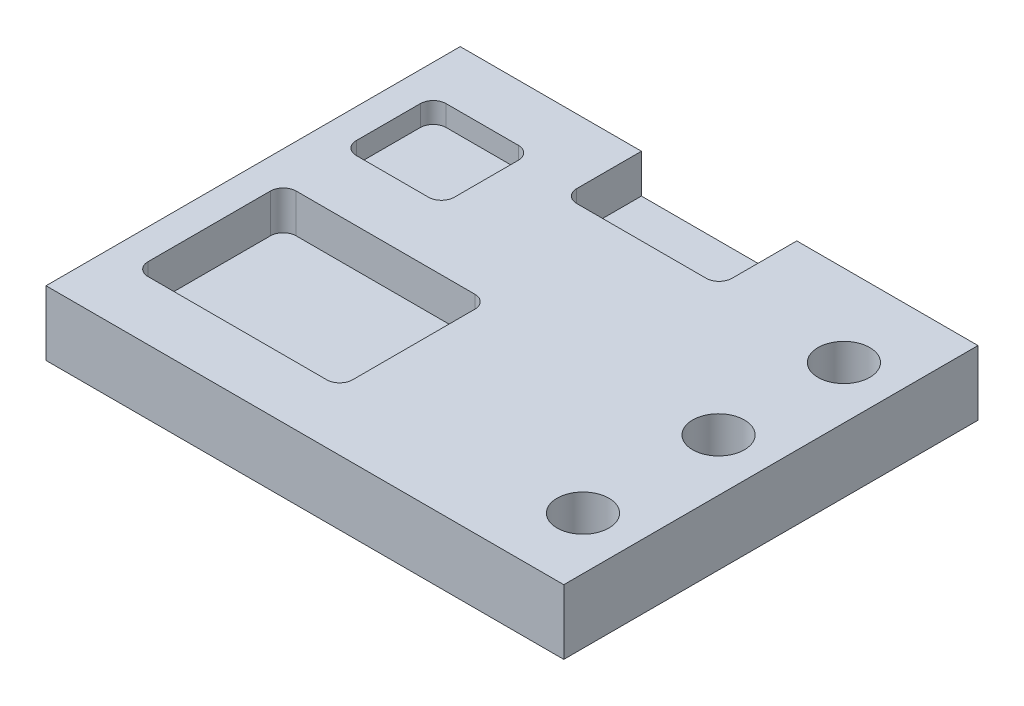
ISO-10303-21;
HEADER;
FILE_DESCRIPTION(('STEP AP214'),'2;1');
FILE_NAME('part.step','',(''),(''),'','','');
FILE_SCHEMA(('AUTOMOTIVE_DESIGN { 1 0 10303 214 1 1 1 1 }'));
ENDSEC;
DATA;
#1=APPLICATION_CONTEXT('core data for automotive mechanical design processes');
#2=APPLICATION_PROTOCOL_DEFINITION('international standard','automotive_design',2000,#1);
#3=PRODUCT_CONTEXT('',#1,'mechanical');
#4=PRODUCT('Part','Part','',(#3));
#5=PRODUCT_RELATED_PRODUCT_CATEGORY('part','',(#4));
#6=PRODUCT_DEFINITION_FORMATION('','',#4);
#7=PRODUCT_DEFINITION_CONTEXT('part definition',#1,'design');
#8=PRODUCT_DEFINITION('design','',#6,#7);
#9=PRODUCT_DEFINITION_SHAPE('','',#8);
#10=(LENGTH_UNIT() NAMED_UNIT(*) SI_UNIT(.MILLI.,.METRE.));
#11=(NAMED_UNIT(*) PLANE_ANGLE_UNIT() SI_UNIT($,.RADIAN.));
#12=(NAMED_UNIT(*) SI_UNIT($,.STERADIAN.) SOLID_ANGLE_UNIT());
#13=UNCERTAINTY_MEASURE_WITH_UNIT(LENGTH_MEASURE(1.E-05),#10,'distance_accuracy_value','');
#14=(GEOMETRIC_REPRESENTATION_CONTEXT(3) GLOBAL_UNCERTAINTY_ASSIGNED_CONTEXT((#13)) GLOBAL_UNIT_ASSIGNED_CONTEXT((#10,
#11,#12)) REPRESENTATION_CONTEXT('',''));
#15=CARTESIAN_POINT('',(0.,0.,0.));
#16=DIRECTION('',(0.,0.,1.));
#17=DIRECTION('',(1.,0.,0.));
#18=AXIS2_PLACEMENT_3D('',#15,#16,#17);
#19=CARTESIAN_POINT('',(-63.5,15.875,-50.8));
#20=DIRECTION('',(1.,0.,0.));
#21=DIRECTION('',(0.,0.,-1.));
#22=AXIS2_PLACEMENT_3D('',#19,#20,#21);
#23=PLANE('',#22);
#24=DIRECTION('',(0.,0.,1.));
#25=VECTOR('',#24,1.);
#26=CARTESIAN_POINT('',(-63.5,0.,-50.8));
#27=LINE('',#26,#25);
#28=CARTESIAN_POINT('',(-63.5,0.,-50.8));
#29=VERTEX_POINT('',#28);
#30=CARTESIAN_POINT('',(-63.5,0.,50.8));
#31=VERTEX_POINT('',#30);
#32=EDGE_CURVE('E370',#29,#31,#27,.T.);
#33=ORIENTED_EDGE('',*,*,#32,.T.);
#34=DIRECTION('',(0.,-1.,0.));
#35=VECTOR('',#34,1.);
#36=CARTESIAN_POINT('',(-63.5,15.875,50.8));
#37=LINE('',#36,#35);
#38=CARTESIAN_POINT('',(-63.5,15.875,50.8));
#39=VERTEX_POINT('',#38);
#40=EDGE_CURVE('E253',#39,#31,#37,.T.);
#41=ORIENTED_EDGE('',*,*,#40,.F.);
#42=DIRECTION('',(0.,0.,1.));
#43=VECTOR('',#42,1.);
#44=CARTESIAN_POINT('',(-63.5,15.875,-50.8));
#45=LINE('',#44,#43);
#46=CARTESIAN_POINT('',(-63.5,15.875,-50.8));
#47=VERTEX_POINT('',#46);
#48=EDGE_CURVE('E379',#47,#39,#45,.T.);
#49=ORIENTED_EDGE('',*,*,#48,.F.);
#50=DIRECTION('',(0.,-1.,0.));
#51=VECTOR('',#50,1.);
#52=CARTESIAN_POINT('',(-63.5,15.875,-50.8));
#53=LINE('',#52,#51);
#54=EDGE_CURVE('E240',#47,#29,#53,.T.);
#55=ORIENTED_EDGE('',*,*,#54,.T.);
#56=EDGE_LOOP('',(#33,#41,#49,#55));
#57=FACE_BOUND('',#56,.T.);
#58=ADVANCED_FACE('F39',(#57),#23,.F.);
#59=CARTESIAN_POINT('',(-63.5,15.875,50.8));
#60=DIRECTION('',(0.,0.,-1.));
#61=DIRECTION('',(-1.,0.,0.));
#62=AXIS2_PLACEMENT_3D('',#59,#60,#61);
#63=PLANE('',#62);
#64=DIRECTION('',(1.,0.,0.));
#65=VECTOR('',#64,1.);
#66=CARTESIAN_POINT('',(-63.5,0.,50.8));
#67=LINE('',#66,#65);
#68=CARTESIAN_POINT('',(63.5,0.,50.8));
#69=VERTEX_POINT('',#68);
#70=EDGE_CURVE('E373',#31,#69,#67,.T.);
#71=ORIENTED_EDGE('',*,*,#70,.T.);
#72=DIRECTION('',(0.,-1.,0.));
#73=VECTOR('',#72,1.);
#74=CARTESIAN_POINT('',(63.5,15.875,50.8));
#75=LINE('',#74,#73);
#76=CARTESIAN_POINT('',(63.5,15.875,50.8));
#77=VERTEX_POINT('',#76);
#78=EDGE_CURVE('E250',#77,#69,#75,.T.);
#79=ORIENTED_EDGE('',*,*,#78,.F.);
#80=DIRECTION('',(1.,0.,0.));
#81=VECTOR('',#80,1.);
#82=CARTESIAN_POINT('',(-63.5,15.875,50.8));
#83=LINE('',#82,#81);
#84=EDGE_CURVE('E381',#39,#77,#83,.T.);
#85=ORIENTED_EDGE('',*,*,#84,.F.);
#86=ORIENTED_EDGE('',*,*,#40,.T.);
#87=EDGE_LOOP('',(#71,#79,#85,#86));
#88=FACE_BOUND('',#87,.T.);
#89=ADVANCED_FACE('F389',(#88),#63,.F.);
#90=CARTESIAN_POINT('',(63.5,15.875,-50.8));
#91=DIRECTION('',(-1.,0.,0.));
#92=DIRECTION('',(0.,0.,1.));
#93=AXIS2_PLACEMENT_3D('',#90,#91,#92);
#94=PLANE('',#93);
#95=DIRECTION('',(0.,0.,-1.));
#96=VECTOR('',#95,1.);
#97=CARTESIAN_POINT('',(63.5,0.,-50.8));
#98=LINE('',#97,#96);
#99=CARTESIAN_POINT('',(63.5,0.,-50.8));
#100=VERTEX_POINT('',#99);
#101=EDGE_CURVE('E375',#69,#100,#98,.T.);
#102=ORIENTED_EDGE('',*,*,#101,.T.);
#103=DIRECTION('',(0.,-1.,0.));
#104=VECTOR('',#103,1.);
#105=CARTESIAN_POINT('',(63.5,15.875,-50.8));
#106=LINE('',#105,#104);
#107=CARTESIAN_POINT('',(63.5,15.875,-50.8));
#108=VERTEX_POINT('',#107);
#109=EDGE_CURVE('E244',#108,#100,#106,.T.);
#110=ORIENTED_EDGE('',*,*,#109,.F.);
#111=DIRECTION('',(0.,0.,-1.));
#112=VECTOR('',#111,1.);
#113=CARTESIAN_POINT('',(63.5,15.875,-50.8));
#114=LINE('',#113,#112);
#115=EDGE_CURVE('E238',#77,#108,#114,.T.);
#116=ORIENTED_EDGE('',*,*,#115,.F.);
#117=ORIENTED_EDGE('',*,*,#78,.T.);
#118=EDGE_LOOP('',(#102,#110,#116,#117));
#119=FACE_BOUND('',#118,.T.);
#120=ADVANCED_FACE('F392',(#119),#94,.F.);
#121=CARTESIAN_POINT('',(-63.5,15.875,-50.8));
#122=DIRECTION('',(0.,0.,1.));
#123=DIRECTION('',(1.,0.,0.));
#124=AXIS2_PLACEMENT_3D('',#121,#122,#123);
#125=PLANE('',#124);
#126=DIRECTION('',(-1.,0.,0.));
#127=VECTOR('',#126,1.);
#128=CARTESIAN_POINT('',(-19.05,6.35,-50.8));
#129=LINE('',#128,#127);
#130=CARTESIAN_POINT('',(19.05,6.35,-50.8));
#131=VERTEX_POINT('',#130);
#132=CARTESIAN_POINT('',(-19.05,6.35,-50.8));
#133=VERTEX_POINT('',#132);
#134=EDGE_CURVE('E222',#131,#133,#129,.T.);
#135=ORIENTED_EDGE('',*,*,#134,.F.);
#136=DIRECTION('',(0.,1.,0.));
#137=VECTOR('',#136,1.);
#138=CARTESIAN_POINT('',(19.05,6.35,-50.8));
#139=LINE('',#138,#137);
#140=CARTESIAN_POINT('',(19.05,15.875,-50.8));
#141=VERTEX_POINT('',#140);
#142=EDGE_CURVE('E216',#131,#141,#139,.T.);
#143=ORIENTED_EDGE('',*,*,#142,.T.);
#144=DIRECTION('',(-1.,0.,0.));
#145=VECTOR('',#144,1.);
#146=CARTESIAN_POINT('',(-63.5,15.875,-50.8));
#147=LINE('',#146,#145);
#148=EDGE_CURVE('E229',#108,#141,#147,.T.);
#149=ORIENTED_EDGE('',*,*,#148,.F.);
#150=ORIENTED_EDGE('',*,*,#109,.T.);
#151=DIRECTION('',(-1.,0.,0.));
#152=VECTOR('',#151,1.);
#153=CARTESIAN_POINT('',(-63.5,0.,-50.8));
#154=LINE('',#153,#152);
#155=EDGE_CURVE('E377',#100,#29,#154,.T.);
#156=ORIENTED_EDGE('',*,*,#155,.T.);
#157=ORIENTED_EDGE('',*,*,#54,.F.);
#158=CARTESIAN_POINT('',(-19.05,15.875,-50.8));
#159=VERTEX_POINT('',#158);
#160=EDGE_CURVE('E241',#159,#47,#147,.T.);
#161=ORIENTED_EDGE('',*,*,#160,.F.);
#162=DIRECTION('',(0.,1.,0.));
#163=VECTOR('',#162,1.);
#164=CARTESIAN_POINT('',(-19.05,6.35,-50.8));
#165=LINE('',#164,#163);
#166=EDGE_CURVE('E233',#133,#159,#165,.T.);
#167=ORIENTED_EDGE('',*,*,#166,.F.);
#168=EDGE_LOOP('',(#135,#143,#149,#150,#156,#157,#161,#167));
#169=FACE_BOUND('',#168,.T.);
#170=ADVANCED_FACE('F227',(#169),#125,.F.);
#171=CARTESIAN_POINT('',(-63.5,15.875,50.8));
#172=DIRECTION('',(0.,1.,0.));
#173=DIRECTION('',(0.,0.,1.));
#174=AXIS2_PLACEMENT_3D('',#171,#172,#173);
#175=PLANE('',#174);
#176=CARTESIAN_POINT('',(50.6552706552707,15.875,33.2425213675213));
#177=DIRECTION('',(0.,1.,0.));
#178=DIRECTION('',(0.,0.,1.));
#179=AXIS2_PLACEMENT_3D('',#176,#177,#178);
#180=CIRCLE('',#179,6.35);
#181=CARTESIAN_POINT('',(50.6552706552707,15.875,39.5925213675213));
#182=VERTEX_POINT('',#181);
#183=EDGE_CURVE('E851',#182,#182,#180,.T.);
#184=ORIENTED_EDGE('',*,*,#183,.F.);
#185=EDGE_LOOP('',(#184));
#186=FACE_BOUND('',#185,.T.);
#187=CARTESIAN_POINT('',(50.6552706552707,15.875,0.));
#188=DIRECTION('',(0.,1.,0.));
#189=DIRECTION('',(0.,0.,1.));
#190=AXIS2_PLACEMENT_3D('',#187,#188,#189);
#191=CIRCLE('',#190,6.35);
#192=CARTESIAN_POINT('',(50.6552706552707,15.875,6.35));
#193=VERTEX_POINT('',#192);
#194=EDGE_CURVE('E843',#193,#193,#191,.T.);
#195=ORIENTED_EDGE('',*,*,#194,.F.);
#196=EDGE_LOOP('',(#195));
#197=FACE_BOUND('',#196,.T.);
#198=CARTESIAN_POINT('',(50.6552706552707,15.875,-30.7549857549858));
#199=DIRECTION('',(0.,1.,0.));
#200=DIRECTION('',(0.,0.,1.));
#201=AXIS2_PLACEMENT_3D('',#198,#199,#200);
#202=CIRCLE('',#201,6.35);
#203=CARTESIAN_POINT('',(50.6552706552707,15.875,-24.4049857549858));
#204=VERTEX_POINT('',#203);
#205=EDGE_CURVE('E411',#204,#204,#202,.T.);
#206=ORIENTED_EDGE('',*,*,#205,.F.);
#207=EDGE_LOOP('',(#206));
#208=FACE_BOUND('',#207,.T.);
#209=DIRECTION('',(0.,0.,-1.));
#210=VECTOR('',#209,1.);
#211=CARTESIAN_POINT('',(19.05,15.875,-50.8));
#212=LINE('',#211,#210);
#213=CARTESIAN_POINT('',(19.05,15.875,-34.925));
#214=VERTEX_POINT('',#213);
#215=EDGE_CURVE('E212',#214,#141,#212,.T.);
#216=ORIENTED_EDGE('',*,*,#215,.F.);
#217=CARTESIAN_POINT('',(15.875,15.875,-34.925));
#218=DIRECTION('',(0.,1.,0.));
#219=DIRECTION('',(0.,0.,1.));
#220=AXIS2_PLACEMENT_3D('',#217,#218,#219);
#221=CIRCLE('',#220,3.175);
#222=CARTESIAN_POINT('',(15.875,15.875,-31.75));
#223=VERTEX_POINT('',#222);
#224=EDGE_CURVE('E325',#214,#223,#221,.F.);
#225=ORIENTED_EDGE('',*,*,#224,.T.);
#226=DIRECTION('',(1.,0.,0.));
#227=VECTOR('',#226,1.);
#228=CARTESIAN_POINT('',(19.05,15.875,-31.75));
#229=LINE('',#228,#227);
#230=CARTESIAN_POINT('',(-15.875,15.875,-31.75));
#231=VERTEX_POINT('',#230);
#232=EDGE_CURVE('E223',#231,#223,#229,.T.);
#233=ORIENTED_EDGE('',*,*,#232,.F.);
#234=CARTESIAN_POINT('',(-15.875,15.875,-34.925));
#235=DIRECTION('',(0.,1.,0.));
#236=DIRECTION('',(0.,0.,1.));
#237=AXIS2_PLACEMENT_3D('',#234,#235,#236);
#238=CIRCLE('',#237,3.175);
#239=CARTESIAN_POINT('',(-19.05,15.875,-34.925));
#240=VERTEX_POINT('',#239);
#241=EDGE_CURVE('E323',#231,#240,#238,.F.);
#242=ORIENTED_EDGE('',*,*,#241,.T.);
#243=DIRECTION('',(0.,0.,1.));
#244=VECTOR('',#243,1.);
#245=CARTESIAN_POINT('',(-19.05,15.875,-31.75));
#246=LINE('',#245,#244);
#247=EDGE_CURVE('E402',#159,#240,#246,.T.);
#248=ORIENTED_EDGE('',*,*,#247,.F.);
#249=ORIENTED_EDGE('',*,*,#160,.T.);
#250=ORIENTED_EDGE('',*,*,#48,.T.);
#251=ORIENTED_EDGE('',*,*,#84,.T.);
#252=ORIENTED_EDGE('',*,*,#115,.T.);
#253=ORIENTED_EDGE('',*,*,#148,.T.);
#254=EDGE_LOOP('',(#216,#225,#233,#242,#248,#249,#250,#251,#252,#253));
#255=FACE_BOUND('',#254,.T.);
#256=DIRECTION('',(0.,0.,1.));
#257=VECTOR('',#256,1.);
#258=CARTESIAN_POINT('',(-56.1002057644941,15.875,0.));
#259=LINE('',#258,#257);
#260=CARTESIAN_POINT('',(-56.1002057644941,15.875,3.175));
#261=VERTEX_POINT('',#260);
#262=CARTESIAN_POINT('',(-56.1002057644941,15.875,33.1700931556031));
#263=VERTEX_POINT('',#262);
#264=EDGE_CURVE('E232',#261,#263,#259,.T.);
#265=ORIENTED_EDGE('',*,*,#264,.F.);
#266=CARTESIAN_POINT('',(-52.9252057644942,15.875,3.175));
#267=DIRECTION('',(0.,1.,0.));
#268=DIRECTION('',(0.,0.,1.));
#269=AXIS2_PLACEMENT_3D('',#266,#267,#268);
#270=CIRCLE('',#269,3.175);
#271=CARTESIAN_POINT('',(-52.9252057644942,15.875,0.));
#272=VERTEX_POINT('',#271);
#273=EDGE_CURVE('E11',#261,#272,#270,.F.);
#274=ORIENTED_EDGE('',*,*,#273,.T.);
#275=DIRECTION('',(-1.,0.,0.));
#276=VECTOR('',#275,1.);
#277=CARTESIAN_POINT('',(-56.1002057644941,15.875,0.));
#278=LINE('',#277,#276);
#279=CARTESIAN_POINT('',(-9.09593796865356,15.875,0.));
#280=VERTEX_POINT('',#279);
#281=EDGE_CURVE('E433',#280,#272,#278,.T.);
#282=ORIENTED_EDGE('',*,*,#281,.F.);
#283=CARTESIAN_POINT('',(-9.09593796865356,15.875,3.175));
#284=DIRECTION('',(0.,1.,0.));
#285=DIRECTION('',(0.,0.,1.));
#286=AXIS2_PLACEMENT_3D('',#283,#284,#285);
#287=CIRCLE('',#286,3.175);
#288=CARTESIAN_POINT('',(-5.92093796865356,15.875,3.175));
#289=VERTEX_POINT('',#288);
#290=EDGE_CURVE('E329',#280,#289,#287,.F.);
#291=ORIENTED_EDGE('',*,*,#290,.T.);
#292=DIRECTION('',(0.,0.,-1.));
#293=VECTOR('',#292,1.);
#294=CARTESIAN_POINT('',(-5.92093796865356,15.875,0.));
#295=LINE('',#294,#293);
#296=CARTESIAN_POINT('',(-5.92093796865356,15.875,33.1700931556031));
#297=VERTEX_POINT('',#296);
#298=EDGE_CURVE('E430',#297,#289,#295,.T.);
#299=ORIENTED_EDGE('',*,*,#298,.F.);
#300=CARTESIAN_POINT('',(-9.09593796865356,15.875,33.1700931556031));
#301=DIRECTION('',(0.,1.,0.));
#302=DIRECTION('',(0.,0.,1.));
#303=AXIS2_PLACEMENT_3D('',#300,#301,#302);
#304=CIRCLE('',#303,3.175);
#305=CARTESIAN_POINT('',(-9.09593796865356,15.875,36.3450931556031));
#306=VERTEX_POINT('',#305);
#307=EDGE_CURVE('E327',#297,#306,#304,.F.);
#308=ORIENTED_EDGE('',*,*,#307,.T.);
#309=DIRECTION('',(1.,0.,0.));
#310=VECTOR('',#309,1.);
#311=CARTESIAN_POINT('',(-56.1002057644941,15.875,36.3450931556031));
#312=LINE('',#311,#310);
#313=CARTESIAN_POINT('',(-52.9252057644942,15.875,36.3450931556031));
#314=VERTEX_POINT('',#313);
#315=EDGE_CURVE('E427',#314,#306,#312,.T.);
#316=ORIENTED_EDGE('',*,*,#315,.F.);
#317=CARTESIAN_POINT('',(-52.9252057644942,15.875,33.1700931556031));
#318=DIRECTION('',(0.,1.,0.));
#319=DIRECTION('',(0.,0.,1.));
#320=AXIS2_PLACEMENT_3D('',#317,#318,#319);
#321=CIRCLE('',#320,3.175);
#322=EDGE_CURVE('E331',#314,#263,#321,.F.);
#323=ORIENTED_EDGE('',*,*,#322,.T.);
#324=EDGE_LOOP('',(#265,#274,#282,#291,#299,#308,#316,#323));
#325=FACE_BOUND('',#324,.T.);
#326=DIRECTION('',(0.,0.,1.));
#327=VECTOR('',#326,1.);
#328=CARTESIAN_POINT('',(-56.2829435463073,15.875,-36.9596704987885));
#329=LINE('',#328,#327);
#330=CARTESIAN_POINT('',(-56.2829435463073,15.875,-33.7846704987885));
#331=VERTEX_POINT('',#330);
#332=CARTESIAN_POINT('',(-56.2829435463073,15.875,-18.0892141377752));
#333=VERTEX_POINT('',#332);
#334=EDGE_CURVE('E340',#331,#333,#329,.T.);
#335=ORIENTED_EDGE('',*,*,#334,.F.);
#336=CARTESIAN_POINT('',(-53.1079435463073,15.875,-33.7846704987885));
#337=DIRECTION('',(0.,1.,0.));
#338=DIRECTION('',(0.,0.,1.));
#339=AXIS2_PLACEMENT_3D('',#336,#337,#338);
#340=CIRCLE('',#339,3.175);
#341=CARTESIAN_POINT('',(-53.1079435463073,15.875,-36.9596704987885));
#342=VERTEX_POINT('',#341);
#343=EDGE_CURVE('E46',#331,#342,#340,.F.);
#344=ORIENTED_EDGE('',*,*,#343,.T.);
#345=DIRECTION('',(-1.,0.,0.));
#346=VECTOR('',#345,1.);
#347=CARTESIAN_POINT('',(-56.2829435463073,15.875,-36.9596704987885));
#348=LINE('',#347,#346);
#349=CARTESIAN_POINT('',(-35.3992387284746,15.875,-36.9596704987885));
#350=VERTEX_POINT('',#349);
#351=EDGE_CURVE('E339',#350,#342,#348,.T.);
#352=ORIENTED_EDGE('',*,*,#351,.F.);
#353=CARTESIAN_POINT('',(-35.3992387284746,15.875,-33.7846704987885));
#354=DIRECTION('',(0.,1.,0.));
#355=DIRECTION('',(0.,0.,1.));
#356=AXIS2_PLACEMENT_3D('',#353,#354,#355);
#357=CIRCLE('',#356,3.175);
#358=CARTESIAN_POINT('',(-32.2242387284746,15.875,-33.7846704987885));
#359=VERTEX_POINT('',#358);
#360=EDGE_CURVE('E333',#350,#359,#357,.F.);
#361=ORIENTED_EDGE('',*,*,#360,.T.);
#362=DIRECTION('',(0.,0.,-1.));
#363=VECTOR('',#362,1.);
#364=CARTESIAN_POINT('',(-32.2242387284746,15.875,-36.9596704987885));
#365=LINE('',#364,#363);
#366=CARTESIAN_POINT('',(-32.2242387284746,15.875,-18.0892141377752));
#367=VERTEX_POINT('',#366);
#368=EDGE_CURVE('E347',#367,#359,#365,.T.);
#369=ORIENTED_EDGE('',*,*,#368,.F.);
#370=CARTESIAN_POINT('',(-35.3992387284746,15.875,-18.0892141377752));
#371=DIRECTION('',(0.,1.,0.));
#372=DIRECTION('',(0.,0.,1.));
#373=AXIS2_PLACEMENT_3D('',#370,#371,#372);
#374=CIRCLE('',#373,3.175);
#375=CARTESIAN_POINT('',(-35.3992387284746,15.875,-14.9142141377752));
#376=VERTEX_POINT('',#375);
#377=EDGE_CURVE('E335',#367,#376,#374,.F.);
#378=ORIENTED_EDGE('',*,*,#377,.T.);
#379=DIRECTION('',(1.,0.,0.));
#380=VECTOR('',#379,1.);
#381=CARTESIAN_POINT('',(-56.2829435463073,15.875,-14.9142141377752));
#382=LINE('',#381,#380);
#383=CARTESIAN_POINT('',(-53.1079435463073,15.875,-14.9142141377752));
#384=VERTEX_POINT('',#383);
#385=EDGE_CURVE('E449',#384,#376,#382,.T.);
#386=ORIENTED_EDGE('',*,*,#385,.F.);
#387=CARTESIAN_POINT('',(-53.1079435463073,15.875,-18.0892141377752));
#388=DIRECTION('',(0.,1.,0.));
#389=DIRECTION('',(0.,0.,1.));
#390=AXIS2_PLACEMENT_3D('',#387,#388,#389);
#391=CIRCLE('',#390,3.175);
#392=EDGE_CURVE('E53',#384,#333,#391,.F.);
#393=ORIENTED_EDGE('',*,*,#392,.T.);
#394=EDGE_LOOP('',(#335,#344,#352,#361,#369,#378,#386,#393));
#395=FACE_BOUND('',#394,.T.);
#396=ADVANCED_FACE('F235',(#186,#197,#208,#255,#325,#395),#175,.T.);
#397=CARTESIAN_POINT('',(-63.5,0.,50.8));
#398=DIRECTION('',(0.,1.,0.));
#399=DIRECTION('',(0.,0.,1.));
#400=AXIS2_PLACEMENT_3D('',#397,#398,#399);
#401=PLANE('',#400);
#402=CARTESIAN_POINT('',(50.6552706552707,0.,33.2425213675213));
#403=DIRECTION('',(0.,1.,0.));
#404=DIRECTION('',(0.,0.,1.));
#405=AXIS2_PLACEMENT_3D('',#402,#403,#404);
#406=CIRCLE('',#405,6.35);
#407=CARTESIAN_POINT('',(50.6552706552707,0.,39.5925213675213));
#408=VERTEX_POINT('',#407);
#409=EDGE_CURVE('E848',#408,#408,#406,.T.);
#410=ORIENTED_EDGE('',*,*,#409,.T.);
#411=EDGE_LOOP('',(#410));
#412=FACE_BOUND('',#411,.T.);
#413=CARTESIAN_POINT('',(50.6552706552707,0.,0.));
#414=DIRECTION('',(0.,1.,0.));
#415=DIRECTION('',(0.,0.,1.));
#416=AXIS2_PLACEMENT_3D('',#413,#414,#415);
#417=CIRCLE('',#416,6.35);
#418=CARTESIAN_POINT('',(50.6552706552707,0.,6.35));
#419=VERTEX_POINT('',#418);
#420=EDGE_CURVE('E841',#419,#419,#417,.T.);
#421=ORIENTED_EDGE('',*,*,#420,.T.);
#422=EDGE_LOOP('',(#421));
#423=FACE_BOUND('',#422,.T.);
#424=CARTESIAN_POINT('',(50.6552706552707,0.,-30.7549857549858));
#425=DIRECTION('',(0.,1.,0.));
#426=DIRECTION('',(0.,0.,1.));
#427=AXIS2_PLACEMENT_3D('',#424,#425,#426);
#428=CIRCLE('',#427,6.35);
#429=CARTESIAN_POINT('',(50.6552706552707,0.,-24.4049857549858));
#430=VERTEX_POINT('',#429);
#431=EDGE_CURVE('E406',#430,#430,#428,.T.);
#432=ORIENTED_EDGE('',*,*,#431,.T.);
#433=EDGE_LOOP('',(#432));
#434=FACE_BOUND('',#433,.T.);
#435=ORIENTED_EDGE('',*,*,#32,.F.);
#436=ORIENTED_EDGE('',*,*,#155,.F.);
#437=ORIENTED_EDGE('',*,*,#101,.F.);
#438=ORIENTED_EDGE('',*,*,#70,.F.);
#439=EDGE_LOOP('',(#435,#436,#437,#438));
#440=FACE_BOUND('',#439,.T.);
#441=ADVANCED_FACE('F397',(#412,#423,#434,#440),#401,.F.);
#442=CARTESIAN_POINT('',(-56.2829435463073,10.795,-36.9596704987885));
#443=DIRECTION('',(-1.,0.,0.));
#444=DIRECTION('',(0.,0.,1.));
#445=AXIS2_PLACEMENT_3D('',#442,#443,#444);
#446=PLANE('',#445);
#447=ORIENTED_EDGE('',*,*,#334,.T.);
#448=DIRECTION('',(0.,1.,0.));
#449=VECTOR('',#448,1.);
#450=CARTESIAN_POINT('',(-56.2829435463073,10.795,-18.0892141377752));
#451=LINE('',#450,#449);
#452=CARTESIAN_POINT('',(-56.2829435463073,10.795,-18.0892141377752));
#453=VERTEX_POINT('',#452);
#454=EDGE_CURVE('E321',#333,#453,#451,.F.);
#455=ORIENTED_EDGE('',*,*,#454,.T.);
#456=DIRECTION('',(0.,0.,1.));
#457=VECTOR('',#456,1.);
#458=CARTESIAN_POINT('',(-56.2829435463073,10.795,-36.9596704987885));
#459=LINE('',#458,#457);
#460=CARTESIAN_POINT('',(-56.2829435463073,10.795,-33.7846704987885));
#461=VERTEX_POINT('',#460);
#462=EDGE_CURVE('E346',#461,#453,#459,.T.);
#463=ORIENTED_EDGE('',*,*,#462,.F.);
#464=DIRECTION('',(0.,1.,0.));
#465=VECTOR('',#464,1.);
#466=CARTESIAN_POINT('',(-56.2829435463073,15.875,-33.7846704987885));
#467=LINE('',#466,#465);
#468=EDGE_CURVE('E319',#461,#331,#467,.T.);
#469=ORIENTED_EDGE('',*,*,#468,.T.);
#470=EDGE_LOOP('',(#447,#455,#463,#469));
#471=FACE_BOUND('',#470,.T.);
#472=ADVANCED_FACE('F359',(#471),#446,.F.);
#473=CARTESIAN_POINT('',(-56.2829435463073,10.795,-36.9596704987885));
#474=DIRECTION('',(0.,0.,-1.));
#475=DIRECTION('',(-1.,0.,0.));
#476=AXIS2_PLACEMENT_3D('',#473,#474,#475);
#477=PLANE('',#476);
#478=DIRECTION('',(-1.,0.,0.));
#479=VECTOR('',#478,1.);
#480=CARTESIAN_POINT('',(-56.2829435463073,10.795,-36.9596704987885));
#481=LINE('',#480,#479);
#482=CARTESIAN_POINT('',(-35.3992387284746,10.795,-36.9596704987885));
#483=VERTEX_POINT('',#482);
#484=CARTESIAN_POINT('',(-53.1079435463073,10.795,-36.9596704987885));
#485=VERTEX_POINT('',#484);
#486=EDGE_CURVE('E357',#483,#485,#481,.T.);
#487=ORIENTED_EDGE('',*,*,#486,.F.);
#488=DIRECTION('',(0.,1.,0.));
#489=VECTOR('',#488,1.);
#490=CARTESIAN_POINT('',(-35.3992387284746,15.875,-36.9596704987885));
#491=LINE('',#490,#489);
#492=EDGE_CURVE('E298',#483,#350,#491,.T.);
#493=ORIENTED_EDGE('',*,*,#492,.T.);
#494=ORIENTED_EDGE('',*,*,#351,.T.);
#495=DIRECTION('',(0.,1.,0.));
#496=VECTOR('',#495,1.);
#497=CARTESIAN_POINT('',(-53.1079435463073,10.795,-36.9596704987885));
#498=LINE('',#497,#496);
#499=EDGE_CURVE('E296',#342,#485,#498,.F.);
#500=ORIENTED_EDGE('',*,*,#499,.T.);
#501=EDGE_LOOP('',(#487,#493,#494,#500));
#502=FACE_BOUND('',#501,.T.);
#503=ADVANCED_FACE('F343',(#502),#477,.F.);
#504=CARTESIAN_POINT('',(-32.2242387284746,10.795,-36.9596704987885));
#505=DIRECTION('',(1.,0.,0.));
#506=DIRECTION('',(0.,0.,-1.));
#507=AXIS2_PLACEMENT_3D('',#504,#505,#506);
#508=PLANE('',#507);
#509=ORIENTED_EDGE('',*,*,#368,.T.);
#510=DIRECTION('',(0.,1.,0.));
#511=VECTOR('',#510,1.);
#512=CARTESIAN_POINT('',(-32.2242387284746,10.795,-33.7846704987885));
#513=LINE('',#512,#511);
#514=CARTESIAN_POINT('',(-32.2242387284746,10.795,-33.7846704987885));
#515=VERTEX_POINT('',#514);
#516=EDGE_CURVE('E304',#359,#515,#513,.F.);
#517=ORIENTED_EDGE('',*,*,#516,.T.);
#518=DIRECTION('',(0.,0.,-1.));
#519=VECTOR('',#518,1.);
#520=CARTESIAN_POINT('',(-32.2242387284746,10.795,-36.9596704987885));
#521=LINE('',#520,#519);
#522=CARTESIAN_POINT('',(-32.2242387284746,10.795,-18.0892141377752));
#523=VERTEX_POINT('',#522);
#524=EDGE_CURVE('E364',#523,#515,#521,.T.);
#525=ORIENTED_EDGE('',*,*,#524,.F.);
#526=DIRECTION('',(0.,1.,0.));
#527=VECTOR('',#526,1.);
#528=CARTESIAN_POINT('',(-32.2242387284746,15.875,-18.0892141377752));
#529=LINE('',#528,#527);
#530=EDGE_CURVE('E301',#523,#367,#529,.T.);
#531=ORIENTED_EDGE('',*,*,#530,.T.);
#532=EDGE_LOOP('',(#509,#517,#525,#531));
#533=FACE_BOUND('',#532,.T.);
#534=ADVANCED_FACE('F455',(#533),#508,.F.);
#535=CARTESIAN_POINT('',(-56.2829435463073,10.795,-14.9142141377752));
#536=DIRECTION('',(0.,0.,1.));
#537=DIRECTION('',(1.,0.,0.));
#538=AXIS2_PLACEMENT_3D('',#535,#536,#537);
#539=PLANE('',#538);
#540=ORIENTED_EDGE('',*,*,#385,.T.);
#541=DIRECTION('',(0.,1.,0.));
#542=VECTOR('',#541,1.);
#543=CARTESIAN_POINT('',(-35.3992387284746,10.795,-14.9142141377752));
#544=LINE('',#543,#542);
#545=CARTESIAN_POINT('',(-35.3992387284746,10.795,-14.9142141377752));
#546=VERTEX_POINT('',#545);
#547=EDGE_CURVE('E317',#376,#546,#544,.F.);
#548=ORIENTED_EDGE('',*,*,#547,.T.);
#549=DIRECTION('',(1.,0.,0.));
#550=VECTOR('',#549,1.);
#551=CARTESIAN_POINT('',(-56.2829435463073,10.795,-14.9142141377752));
#552=LINE('',#551,#550);
#553=CARTESIAN_POINT('',(-53.1079435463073,10.795,-14.9142141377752));
#554=VERTEX_POINT('',#553);
#555=EDGE_CURVE('E361',#554,#546,#552,.T.);
#556=ORIENTED_EDGE('',*,*,#555,.F.);
#557=DIRECTION('',(0.,1.,0.));
#558=VECTOR('',#557,1.);
#559=CARTESIAN_POINT('',(-53.1079435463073,15.875,-14.9142141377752));
#560=LINE('',#559,#558);
#561=EDGE_CURVE('E314',#554,#384,#560,.T.);
#562=ORIENTED_EDGE('',*,*,#561,.T.);
#563=EDGE_LOOP('',(#540,#548,#556,#562));
#564=FACE_BOUND('',#563,.T.);
#565=ADVANCED_FACE('F466',(#564),#539,.F.);
#566=CARTESIAN_POINT('',(-56.2829435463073,10.795,-14.9142141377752));
#567=DIRECTION('',(0.,1.,0.));
#568=DIRECTION('',(0.,0.,1.));
#569=AXIS2_PLACEMENT_3D('',#566,#567,#568);
#570=PLANE('',#569);
#571=ORIENTED_EDGE('',*,*,#524,.T.);
#572=CARTESIAN_POINT('',(-35.3992387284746,10.795,-33.7846704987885));
#573=DIRECTION('',(0.,1.,0.));
#574=DIRECTION('',(0.,0.,1.));
#575=AXIS2_PLACEMENT_3D('',#572,#573,#574);
#576=CIRCLE('',#575,3.175);
#577=EDGE_CURVE('E312',#515,#483,#576,.T.);
#578=ORIENTED_EDGE('',*,*,#577,.T.);
#579=ORIENTED_EDGE('',*,*,#486,.T.);
#580=CARTESIAN_POINT('',(-53.1079435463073,10.795,-33.7846704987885));
#581=DIRECTION('',(0.,1.,0.));
#582=DIRECTION('',(0.,0.,1.));
#583=AXIS2_PLACEMENT_3D('',#580,#581,#582);
#584=CIRCLE('',#583,3.175);
#585=EDGE_CURVE('E306',#485,#461,#584,.T.);
#586=ORIENTED_EDGE('',*,*,#585,.T.);
#587=ORIENTED_EDGE('',*,*,#462,.T.);
#588=CARTESIAN_POINT('',(-53.1079435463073,10.795,-18.0892141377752));
#589=DIRECTION('',(0.,1.,0.));
#590=DIRECTION('',(0.,0.,1.));
#591=AXIS2_PLACEMENT_3D('',#588,#589,#590);
#592=CIRCLE('',#591,3.175);
#593=EDGE_CURVE('E308',#453,#554,#592,.T.);
#594=ORIENTED_EDGE('',*,*,#593,.T.);
#595=ORIENTED_EDGE('',*,*,#555,.T.);
#596=CARTESIAN_POINT('',(-35.3992387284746,10.795,-18.0892141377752));
#597=DIRECTION('',(0.,1.,0.));
#598=DIRECTION('',(0.,0.,1.));
#599=AXIS2_PLACEMENT_3D('',#596,#597,#598);
#600=CIRCLE('',#599,3.175);
#601=EDGE_CURVE('E310',#546,#523,#600,.T.);
#602=ORIENTED_EDGE('',*,*,#601,.T.);
#603=EDGE_LOOP('',(#571,#578,#579,#586,#587,#594,#595,#602));
#604=FACE_BOUND('',#603,.T.);
#605=ADVANCED_FACE('F355',(#604),#570,.T.);
#606=CARTESIAN_POINT('',(-56.1002057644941,6.35,0.));
#607=DIRECTION('',(-1.,0.,0.));
#608=DIRECTION('',(0.,0.,1.));
#609=AXIS2_PLACEMENT_3D('',#606,#607,#608);
#610=PLANE('',#609);
#611=ORIENTED_EDGE('',*,*,#264,.T.);
#612=DIRECTION('',(0.,1.,0.));
#613=VECTOR('',#612,1.);
#614=CARTESIAN_POINT('',(-56.1002057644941,6.35,33.1700931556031));
#615=LINE('',#614,#613);
#616=CARTESIAN_POINT('',(-56.1002057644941,6.35,33.1700931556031));
#617=VERTEX_POINT('',#616);
#618=EDGE_CURVE('E294',#263,#617,#615,.F.);
#619=ORIENTED_EDGE('',*,*,#618,.T.);
#620=DIRECTION('',(0.,0.,1.));
#621=VECTOR('',#620,1.);
#622=CARTESIAN_POINT('',(-56.1002057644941,6.35,0.));
#623=LINE('',#622,#621);
#624=CARTESIAN_POINT('',(-56.1002057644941,6.35,3.175));
#625=VERTEX_POINT('',#624);
#626=EDGE_CURVE('E436',#625,#617,#623,.T.);
#627=ORIENTED_EDGE('',*,*,#626,.F.);
#628=DIRECTION('',(0.,1.,0.));
#629=VECTOR('',#628,1.);
#630=CARTESIAN_POINT('',(-56.1002057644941,15.875,3.175));
#631=LINE('',#630,#629);
#632=EDGE_CURVE('E291',#625,#261,#631,.T.);
#633=ORIENTED_EDGE('',*,*,#632,.T.);
#634=EDGE_LOOP('',(#611,#619,#627,#633));
#635=FACE_BOUND('',#634,.T.);
#636=ADVANCED_FACE('F507',(#635),#610,.F.);
#637=CARTESIAN_POINT('',(-56.1002057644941,6.35,0.));
#638=DIRECTION('',(0.,0.,-1.));
#639=DIRECTION('',(-1.,0.,0.));
#640=AXIS2_PLACEMENT_3D('',#637,#638,#639);
#641=PLANE('',#640);
#642=DIRECTION('',(-1.,0.,0.));
#643=VECTOR('',#642,1.);
#644=CARTESIAN_POINT('',(-56.1002057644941,6.35,0.));
#645=LINE('',#644,#643);
#646=CARTESIAN_POINT('',(-9.09593796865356,6.35,0.));
#647=VERTEX_POINT('',#646);
#648=CARTESIAN_POINT('',(-52.9252057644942,6.35,0.));
#649=VERTEX_POINT('',#648);
#650=EDGE_CURVE('E445',#647,#649,#645,.T.);
#651=ORIENTED_EDGE('',*,*,#650,.F.);
#652=DIRECTION('',(0.,1.,0.));
#653=VECTOR('',#652,1.);
#654=CARTESIAN_POINT('',(-9.09593796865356,15.875,0.));
#655=LINE('',#654,#653);
#656=EDGE_CURVE('E288',#647,#280,#655,.T.);
#657=ORIENTED_EDGE('',*,*,#656,.T.);
#658=ORIENTED_EDGE('',*,*,#281,.T.);
#659=DIRECTION('',(0.,1.,0.));
#660=VECTOR('',#659,1.);
#661=CARTESIAN_POINT('',(-52.9252057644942,6.35,0.));
#662=LINE('',#661,#660);
#663=EDGE_CURVE('E286',#272,#649,#662,.F.);
#664=ORIENTED_EDGE('',*,*,#663,.T.);
#665=EDGE_LOOP('',(#651,#657,#658,#664));
#666=FACE_BOUND('',#665,.T.);
#667=ADVANCED_FACE('F510',(#666),#641,.F.);
#668=CARTESIAN_POINT('',(-5.92093796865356,6.35,0.));
#669=DIRECTION('',(1.,0.,0.));
#670=DIRECTION('',(0.,0.,-1.));
#671=AXIS2_PLACEMENT_3D('',#668,#669,#670);
#672=PLANE('',#671);
#673=DIRECTION('',(0.,0.,-1.));
#674=VECTOR('',#673,1.);
#675=CARTESIAN_POINT('',(-5.92093796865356,6.35,0.));
#676=LINE('',#675,#674);
#677=CARTESIAN_POINT('',(-5.92093796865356,6.35,33.1700931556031));
#678=VERTEX_POINT('',#677);
#679=CARTESIAN_POINT('',(-5.92093796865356,6.35,3.175));
#680=VERTEX_POINT('',#679);
#681=EDGE_CURVE('E442',#678,#680,#676,.T.);
#682=ORIENTED_EDGE('',*,*,#681,.F.);
#683=DIRECTION('',(0.,1.,0.));
#684=VECTOR('',#683,1.);
#685=CARTESIAN_POINT('',(-5.92093796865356,15.875,33.1700931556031));
#686=LINE('',#685,#684);
#687=EDGE_CURVE('E270',#678,#297,#686,.T.);
#688=ORIENTED_EDGE('',*,*,#687,.T.);
#689=ORIENTED_EDGE('',*,*,#298,.T.);
#690=DIRECTION('',(0.,1.,0.));
#691=VECTOR('',#690,1.);
#692=CARTESIAN_POINT('',(-5.92093796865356,6.35,3.175));
#693=LINE('',#692,#691);
#694=EDGE_CURVE('E268',#289,#680,#693,.F.);
#695=ORIENTED_EDGE('',*,*,#694,.T.);
#696=EDGE_LOOP('',(#682,#688,#689,#695));
#697=FACE_BOUND('',#696,.T.);
#698=ADVANCED_FACE('F516',(#697),#672,.F.);
#699=CARTESIAN_POINT('',(-56.1002057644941,6.35,36.3450931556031));
#700=DIRECTION('',(0.,0.,1.));
#701=DIRECTION('',(1.,0.,0.));
#702=AXIS2_PLACEMENT_3D('',#699,#700,#701);
#703=PLANE('',#702);
#704=ORIENTED_EDGE('',*,*,#315,.T.);
#705=DIRECTION('',(0.,1.,0.));
#706=VECTOR('',#705,1.);
#707=CARTESIAN_POINT('',(-9.09593796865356,6.35,36.3450931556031));
#708=LINE('',#707,#706);
#709=CARTESIAN_POINT('',(-9.09593796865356,6.35,36.3450931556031));
#710=VERTEX_POINT('',#709);
#711=EDGE_CURVE('E276',#306,#710,#708,.F.);
#712=ORIENTED_EDGE('',*,*,#711,.T.);
#713=DIRECTION('',(1.,0.,0.));
#714=VECTOR('',#713,1.);
#715=CARTESIAN_POINT('',(-56.1002057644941,6.35,36.3450931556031));
#716=LINE('',#715,#714);
#717=CARTESIAN_POINT('',(-52.9252057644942,6.35,36.3450931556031));
#718=VERTEX_POINT('',#717);
#719=EDGE_CURVE('E439',#718,#710,#716,.T.);
#720=ORIENTED_EDGE('',*,*,#719,.F.);
#721=DIRECTION('',(0.,1.,0.));
#722=VECTOR('',#721,1.);
#723=CARTESIAN_POINT('',(-52.9252057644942,15.875,36.3450931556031));
#724=LINE('',#723,#722);
#725=EDGE_CURVE('E273',#718,#314,#724,.T.);
#726=ORIENTED_EDGE('',*,*,#725,.T.);
#727=EDGE_LOOP('',(#704,#712,#720,#726));
#728=FACE_BOUND('',#727,.T.);
#729=ADVANCED_FACE('F512',(#728),#703,.F.);
#730=CARTESIAN_POINT('',(-56.1002057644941,6.35,36.3450931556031));
#731=DIRECTION('',(0.,1.,0.));
#732=DIRECTION('',(0.,0.,1.));
#733=AXIS2_PLACEMENT_3D('',#730,#731,#732);
#734=PLANE('',#733);
#735=ORIENTED_EDGE('',*,*,#719,.T.);
#736=CARTESIAN_POINT('',(-9.09593796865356,6.35,33.1700931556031));
#737=DIRECTION('',(0.,1.,0.));
#738=DIRECTION('',(0.,0.,1.));
#739=AXIS2_PLACEMENT_3D('',#736,#737,#738);
#740=CIRCLE('',#739,3.175);
#741=EDGE_CURVE('E284',#710,#678,#740,.T.);
#742=ORIENTED_EDGE('',*,*,#741,.T.);
#743=ORIENTED_EDGE('',*,*,#681,.T.);
#744=CARTESIAN_POINT('',(-9.09593796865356,6.35,3.175));
#745=DIRECTION('',(0.,1.,0.));
#746=DIRECTION('',(0.,0.,1.));
#747=AXIS2_PLACEMENT_3D('',#744,#745,#746);
#748=CIRCLE('',#747,3.175);
#749=EDGE_CURVE('E282',#680,#647,#748,.T.);
#750=ORIENTED_EDGE('',*,*,#749,.T.);
#751=ORIENTED_EDGE('',*,*,#650,.T.);
#752=CARTESIAN_POINT('',(-52.9252057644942,6.35,3.175));
#753=DIRECTION('',(0.,1.,0.));
#754=DIRECTION('',(0.,0.,1.));
#755=AXIS2_PLACEMENT_3D('',#752,#753,#754);
#756=CIRCLE('',#755,3.175);
#757=EDGE_CURVE('E278',#649,#625,#756,.T.);
#758=ORIENTED_EDGE('',*,*,#757,.T.);
#759=ORIENTED_EDGE('',*,*,#626,.T.);
#760=CARTESIAN_POINT('',(-52.9252057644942,6.35,33.1700931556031));
#761=DIRECTION('',(0.,1.,0.));
#762=DIRECTION('',(0.,0.,1.));
#763=AXIS2_PLACEMENT_3D('',#760,#761,#762);
#764=CIRCLE('',#763,3.175);
#765=EDGE_CURVE('E280',#617,#718,#764,.T.);
#766=ORIENTED_EDGE('',*,*,#765,.T.);
#767=EDGE_LOOP('',(#735,#742,#743,#750,#751,#758,#759,#766));
#768=FACE_BOUND('',#767,.T.);
#769=ADVANCED_FACE('F515',(#768),#734,.T.);
#770=CARTESIAN_POINT('',(19.05,6.35,-50.8));
#771=DIRECTION('',(1.,0.,0.));
#772=DIRECTION('',(0.,0.,-1.));
#773=AXIS2_PLACEMENT_3D('',#770,#771,#772);
#774=PLANE('',#773);
#775=DIRECTION('',(0.,0.,-1.));
#776=VECTOR('',#775,1.);
#777=CARTESIAN_POINT('',(19.05,6.35,-50.8));
#778=LINE('',#777,#776);
#779=CARTESIAN_POINT('',(19.05,6.35,-34.925));
#780=VERTEX_POINT('',#779);
#781=EDGE_CURVE('E422',#780,#131,#778,.T.);
#782=ORIENTED_EDGE('',*,*,#781,.F.);
#783=DIRECTION('',(0.,1.,0.));
#784=VECTOR('',#783,1.);
#785=CARTESIAN_POINT('',(19.05,15.875,-34.925));
#786=LINE('',#785,#784);
#787=EDGE_CURVE('E219',#780,#214,#786,.T.);
#788=ORIENTED_EDGE('',*,*,#787,.T.);
#789=ORIENTED_EDGE('',*,*,#215,.T.);
#790=ORIENTED_EDGE('',*,*,#142,.F.);
#791=EDGE_LOOP('',(#782,#788,#789,#790));
#792=FACE_BOUND('',#791,.T.);
#793=ADVANCED_FACE('F215',(#792),#774,.F.);
#794=CARTESIAN_POINT('',(19.05,6.35,-31.75));
#795=DIRECTION('',(0.,0.,1.));
#796=DIRECTION('',(1.,0.,0.));
#797=AXIS2_PLACEMENT_3D('',#794,#795,#796);
#798=PLANE('',#797);
#799=DIRECTION('',(1.,0.,0.));
#800=VECTOR('',#799,1.);
#801=CARTESIAN_POINT('',(19.05,6.35,-31.75));
#802=LINE('',#801,#800);
#803=CARTESIAN_POINT('',(-15.875,6.35,-31.75));
#804=VERTEX_POINT('',#803);
#805=CARTESIAN_POINT('',(15.875,6.35,-31.75));
#806=VERTEX_POINT('',#805);
#807=EDGE_CURVE('E419',#804,#806,#802,.T.);
#808=ORIENTED_EDGE('',*,*,#807,.F.);
#809=DIRECTION('',(0.,1.,0.));
#810=VECTOR('',#809,1.);
#811=CARTESIAN_POINT('',(-15.875,15.875,-31.75));
#812=LINE('',#811,#810);
#813=EDGE_CURVE('E258',#804,#231,#812,.T.);
#814=ORIENTED_EDGE('',*,*,#813,.T.);
#815=ORIENTED_EDGE('',*,*,#232,.T.);
#816=DIRECTION('',(0.,1.,0.));
#817=VECTOR('',#816,1.);
#818=CARTESIAN_POINT('',(15.875,6.35,-31.75));
#819=LINE('',#818,#817);
#820=EDGE_CURVE('E256',#223,#806,#819,.F.);
#821=ORIENTED_EDGE('',*,*,#820,.T.);
#822=EDGE_LOOP('',(#808,#814,#815,#821));
#823=FACE_BOUND('',#822,.T.);
#824=ADVANCED_FACE('F531',(#823),#798,.F.);
#825=CARTESIAN_POINT('',(-19.05,6.35,-31.75));
#826=DIRECTION('',(-1.,0.,0.));
#827=DIRECTION('',(0.,0.,1.));
#828=AXIS2_PLACEMENT_3D('',#825,#826,#827);
#829=PLANE('',#828);
#830=ORIENTED_EDGE('',*,*,#247,.T.);
#831=DIRECTION('',(0.,1.,0.));
#832=VECTOR('',#831,1.);
#833=CARTESIAN_POINT('',(-19.05,6.35,-34.925));
#834=LINE('',#833,#832);
#835=CARTESIAN_POINT('',(-19.05,6.35,-34.925));
#836=VERTEX_POINT('',#835);
#837=EDGE_CURVE('E261',#240,#836,#834,.F.);
#838=ORIENTED_EDGE('',*,*,#837,.T.);
#839=DIRECTION('',(0.,0.,1.));
#840=VECTOR('',#839,1.);
#841=CARTESIAN_POINT('',(-19.05,6.35,-31.75));
#842=LINE('',#841,#840);
#843=EDGE_CURVE('E416',#133,#836,#842,.T.);
#844=ORIENTED_EDGE('',*,*,#843,.F.);
#845=ORIENTED_EDGE('',*,*,#166,.T.);
#846=EDGE_LOOP('',(#830,#838,#844,#845));
#847=FACE_BOUND('',#846,.T.);
#848=ADVANCED_FACE('F527',(#847),#829,.F.);
#849=CARTESIAN_POINT('',(19.05,6.35,-50.8));
#850=DIRECTION('',(0.,-1.,0.));
#851=DIRECTION('',(0.,0.,-1.));
#852=AXIS2_PLACEMENT_3D('',#849,#850,#851);
#853=PLANE('',#852);
#854=ORIENTED_EDGE('',*,*,#843,.T.);
#855=CARTESIAN_POINT('',(-15.875,6.35,-34.925));
#856=DIRECTION('',(0.,-1.,0.));
#857=DIRECTION('',(0.,0.,-1.));
#858=AXIS2_PLACEMENT_3D('',#855,#856,#857);
#859=CIRCLE('',#858,3.175);
#860=EDGE_CURVE('E265',#836,#804,#859,.F.);
#861=ORIENTED_EDGE('',*,*,#860,.T.);
#862=ORIENTED_EDGE('',*,*,#807,.T.);
#863=CARTESIAN_POINT('',(15.875,6.35,-34.925));
#864=DIRECTION('',(0.,-1.,0.));
#865=DIRECTION('',(0.,0.,-1.));
#866=AXIS2_PLACEMENT_3D('',#863,#864,#865);
#867=CIRCLE('',#866,3.175);
#868=EDGE_CURVE('E263',#806,#780,#867,.F.);
#869=ORIENTED_EDGE('',*,*,#868,.T.);
#870=ORIENTED_EDGE('',*,*,#781,.T.);
#871=ORIENTED_EDGE('',*,*,#134,.T.);
#872=EDGE_LOOP('',(#854,#861,#862,#869,#870,#871));
#873=FACE_BOUND('',#872,.T.);
#874=ADVANCED_FACE('F530',(#873),#853,.F.);
#875=CARTESIAN_POINT('',(-15.875,6.35,-34.925));
#876=DIRECTION('',(0.,-1.,0.));
#877=DIRECTION('',(0.,0.,-1.));
#878=AXIS2_PLACEMENT_3D('',#875,#876,#877);
#879=CYLINDRICAL_SURFACE('',#878,3.175);
#880=ORIENTED_EDGE('',*,*,#860,.F.);
#881=ORIENTED_EDGE('',*,*,#837,.F.);
#882=ORIENTED_EDGE('',*,*,#241,.F.);
#883=ORIENTED_EDGE('',*,*,#813,.F.);
#884=EDGE_LOOP('',(#880,#881,#882,#883));
#885=FACE_BOUND('',#884,.T.);
#886=ADVANCED_FACE('F539',(#885),#879,.F.);
#887=CARTESIAN_POINT('',(15.875,6.35,-34.925));
#888=DIRECTION('',(0.,-1.,0.));
#889=DIRECTION('',(0.,0.,-1.));
#890=AXIS2_PLACEMENT_3D('',#887,#888,#889);
#891=CYLINDRICAL_SURFACE('',#890,3.175);
#892=ORIENTED_EDGE('',*,*,#868,.F.);
#893=ORIENTED_EDGE('',*,*,#820,.F.);
#894=ORIENTED_EDGE('',*,*,#224,.F.);
#895=ORIENTED_EDGE('',*,*,#787,.F.);
#896=EDGE_LOOP('',(#892,#893,#894,#895));
#897=FACE_BOUND('',#896,.T.);
#898=ADVANCED_FACE('F543',(#897),#891,.F.);
#899=CARTESIAN_POINT('',(-9.09593796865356,6.35,33.1700931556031));
#900=DIRECTION('',(0.,-1.,0.));
#901=DIRECTION('',(0.,0.,-1.));
#902=AXIS2_PLACEMENT_3D('',#899,#900,#901);
#903=CYLINDRICAL_SURFACE('',#902,3.175);
#904=ORIENTED_EDGE('',*,*,#741,.F.);
#905=ORIENTED_EDGE('',*,*,#711,.F.);
#906=ORIENTED_EDGE('',*,*,#307,.F.);
#907=ORIENTED_EDGE('',*,*,#687,.F.);
#908=EDGE_LOOP('',(#904,#905,#906,#907));
#909=FACE_BOUND('',#908,.T.);
#910=ADVANCED_FACE('F547',(#909),#903,.F.);
#911=CARTESIAN_POINT('',(-9.09593796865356,6.35,3.175));
#912=DIRECTION('',(0.,-1.,0.));
#913=DIRECTION('',(0.,0.,-1.));
#914=AXIS2_PLACEMENT_3D('',#911,#912,#913);
#915=CYLINDRICAL_SURFACE('',#914,3.175);
#916=ORIENTED_EDGE('',*,*,#749,.F.);
#917=ORIENTED_EDGE('',*,*,#694,.F.);
#918=ORIENTED_EDGE('',*,*,#290,.F.);
#919=ORIENTED_EDGE('',*,*,#656,.F.);
#920=EDGE_LOOP('',(#916,#917,#918,#919));
#921=FACE_BOUND('',#920,.T.);
#922=ADVANCED_FACE('F551',(#921),#915,.F.);
#923=CARTESIAN_POINT('',(-52.9252057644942,6.35,33.1700931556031));
#924=DIRECTION('',(0.,-1.,0.));
#925=DIRECTION('',(0.,0.,-1.));
#926=AXIS2_PLACEMENT_3D('',#923,#924,#925);
#927=CYLINDRICAL_SURFACE('',#926,3.175);
#928=ORIENTED_EDGE('',*,*,#765,.F.);
#929=ORIENTED_EDGE('',*,*,#618,.F.);
#930=ORIENTED_EDGE('',*,*,#322,.F.);
#931=ORIENTED_EDGE('',*,*,#725,.F.);
#932=EDGE_LOOP('',(#928,#929,#930,#931));
#933=FACE_BOUND('',#932,.T.);
#934=ADVANCED_FACE('F555',(#933),#927,.F.);
#935=CARTESIAN_POINT('',(-35.3992387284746,10.795,-33.7846704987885));
#936=DIRECTION('',(0.,-1.,0.));
#937=DIRECTION('',(0.,0.,-1.));
#938=AXIS2_PLACEMENT_3D('',#935,#936,#937);
#939=CYLINDRICAL_SURFACE('',#938,3.175);
#940=ORIENTED_EDGE('',*,*,#577,.F.);
#941=ORIENTED_EDGE('',*,*,#516,.F.);
#942=ORIENTED_EDGE('',*,*,#360,.F.);
#943=ORIENTED_EDGE('',*,*,#492,.F.);
#944=EDGE_LOOP('',(#940,#941,#942,#943));
#945=FACE_BOUND('',#944,.T.);
#946=ADVANCED_FACE('F460',(#945),#939,.F.);
#947=CARTESIAN_POINT('',(-35.3992387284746,10.795,-18.0892141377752));
#948=DIRECTION('',(0.,-1.,0.));
#949=DIRECTION('',(0.,0.,-1.));
#950=AXIS2_PLACEMENT_3D('',#947,#948,#949);
#951=CYLINDRICAL_SURFACE('',#950,3.175);
#952=ORIENTED_EDGE('',*,*,#601,.F.);
#953=ORIENTED_EDGE('',*,*,#547,.F.);
#954=ORIENTED_EDGE('',*,*,#377,.F.);
#955=ORIENTED_EDGE('',*,*,#530,.F.);
#956=EDGE_LOOP('',(#952,#953,#954,#955));
#957=FACE_BOUND('',#956,.T.);
#958=ADVANCED_FACE('F463',(#957),#951,.F.);
#959=CARTESIAN_POINT('',(-53.1079435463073,10.795,-18.0892141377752));
#960=DIRECTION('',(0.,-1.,0.));
#961=DIRECTION('',(0.,0.,-1.));
#962=AXIS2_PLACEMENT_3D('',#959,#960,#961);
#963=CYLINDRICAL_SURFACE('',#962,3.175);
#964=ORIENTED_EDGE('',*,*,#593,.F.);
#965=ORIENTED_EDGE('',*,*,#454,.F.);
#966=ORIENTED_EDGE('',*,*,#392,.F.);
#967=ORIENTED_EDGE('',*,*,#561,.F.);
#968=EDGE_LOOP('',(#964,#965,#966,#967));
#969=FACE_BOUND('',#968,.T.);
#970=ADVANCED_FACE('F470',(#969),#963,.F.);
#971=CARTESIAN_POINT('',(-53.1079435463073,10.795,-33.7846704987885));
#972=DIRECTION('',(0.,-1.,0.));
#973=DIRECTION('',(0.,0.,-1.));
#974=AXIS2_PLACEMENT_3D('',#971,#972,#973);
#975=CYLINDRICAL_SURFACE('',#974,3.175);
#976=ORIENTED_EDGE('',*,*,#585,.F.);
#977=ORIENTED_EDGE('',*,*,#499,.F.);
#978=ORIENTED_EDGE('',*,*,#343,.F.);
#979=ORIENTED_EDGE('',*,*,#468,.F.);
#980=EDGE_LOOP('',(#976,#977,#978,#979));
#981=FACE_BOUND('',#980,.T.);
#982=ADVANCED_FACE('F350',(#981),#975,.F.);
#983=CARTESIAN_POINT('',(-52.9252057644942,6.35,3.175));
#984=DIRECTION('',(0.,-1.,0.));
#985=DIRECTION('',(0.,0.,-1.));
#986=AXIS2_PLACEMENT_3D('',#983,#984,#985);
#987=CYLINDRICAL_SURFACE('',#986,3.175);
#988=ORIENTED_EDGE('',*,*,#757,.F.);
#989=ORIENTED_EDGE('',*,*,#663,.F.);
#990=ORIENTED_EDGE('',*,*,#273,.F.);
#991=ORIENTED_EDGE('',*,*,#632,.F.);
#992=EDGE_LOOP('',(#988,#989,#990,#991));
#993=FACE_BOUND('',#992,.T.);
#994=ADVANCED_FACE('F477',(#993),#987,.F.);
#995=CARTESIAN_POINT('',(50.6552706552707,0.,-30.7549857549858));
#996=DIRECTION('',(0.,1.,0.));
#997=DIRECTION('',(0.,0.,1.));
#998=AXIS2_PLACEMENT_3D('',#995,#996,#997);
#999=CYLINDRICAL_SURFACE('',#998,6.35);
#1000=ORIENTED_EDGE('',*,*,#431,.F.);
#1001=EDGE_LOOP('',(#1000));
#1002=FACE_BOUND('',#1001,.T.);
#1003=ORIENTED_EDGE('',*,*,#205,.T.);
#1004=EDGE_LOOP('',(#1003));
#1005=FACE_BOUND('',#1004,.T.);
#1006=ADVANCED_FACE('F588',(#1002,#1005),#999,.F.);
#1007=CARTESIAN_POINT('',(50.6552706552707,0.,0.));
#1008=DIRECTION('',(0.,1.,0.));
#1009=DIRECTION('',(0.,0.,1.));
#1010=AXIS2_PLACEMENT_3D('',#1007,#1008,#1009);
#1011=CYLINDRICAL_SURFACE('',#1010,6.35);
#1012=ORIENTED_EDGE('',*,*,#420,.F.);
#1013=EDGE_LOOP('',(#1012));
#1014=FACE_BOUND('',#1013,.T.);
#1015=ORIENTED_EDGE('',*,*,#194,.T.);
#1016=EDGE_LOOP('',(#1015));
#1017=FACE_BOUND('',#1016,.T.);
#1018=ADVANCED_FACE('F596',(#1014,#1017),#1011,.F.);
#1019=CARTESIAN_POINT('',(50.6552706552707,0.,33.2425213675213));
#1020=DIRECTION('',(0.,1.,0.));
#1021=DIRECTION('',(0.,0.,1.));
#1022=AXIS2_PLACEMENT_3D('',#1019,#1020,#1021);
#1023=CYLINDRICAL_SURFACE('',#1022,6.35);
#1024=ORIENTED_EDGE('',*,*,#409,.F.);
#1025=EDGE_LOOP('',(#1024));
#1026=FACE_BOUND('',#1025,.T.);
#1027=ORIENTED_EDGE('',*,*,#183,.T.);
#1028=EDGE_LOOP('',(#1027));
#1029=FACE_BOUND('',#1028,.T.);
#1030=ADVANCED_FACE('F602',(#1026,#1029),#1023,.F.);
#1031=CLOSED_SHELL('',(#58,#89,#120,#170,#396,#441,#472,#503,#534,#565,#605,#636,#667,#698,#729,
#769,#793,#824,#848,#874,#886,#898,#910,#922,#934,#946,#958,#970,#982,#994,#1006,#1018,#1030));
#1032=MANIFOLD_SOLID_BREP('B2',#1031);
#1033=ADVANCED_BREP_SHAPE_REPRESENTATION('',(#18,#1032),#14);
#1034=SHAPE_DEFINITION_REPRESENTATION(#9,#1033);
ENDSEC;
END-ISO-10303-21;
